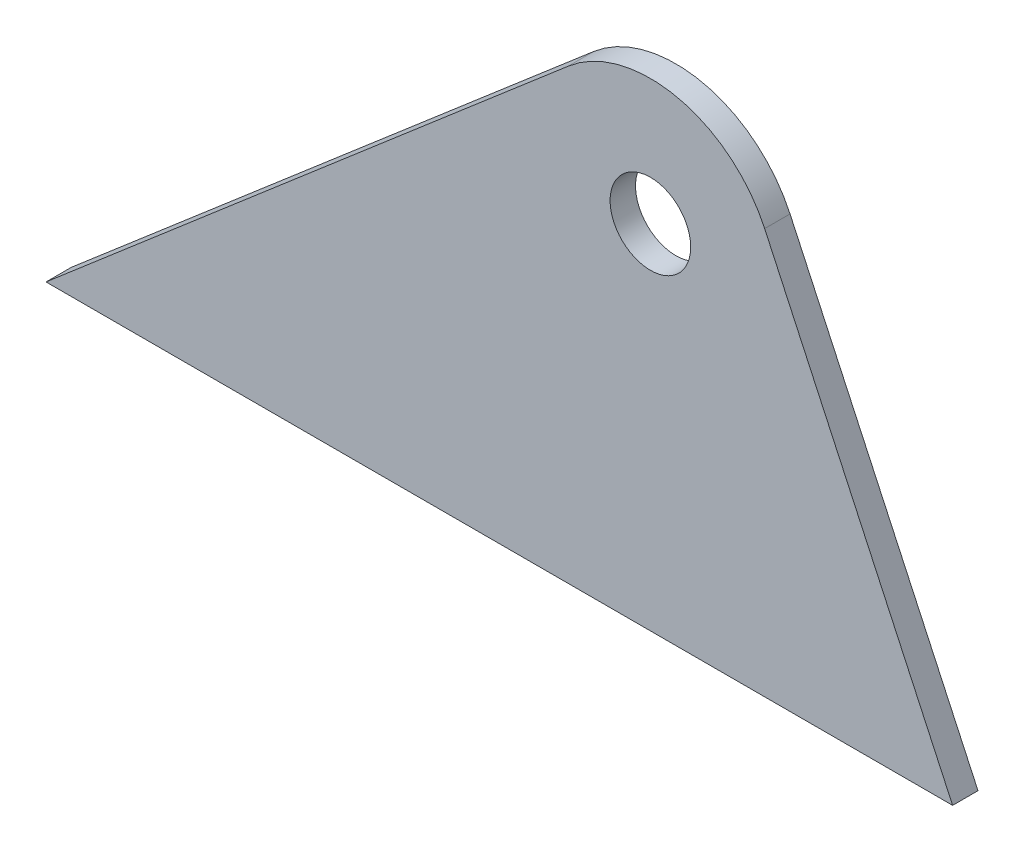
ISO-10303-21;
HEADER;
FILE_DESCRIPTION(('STEP AP214'),'2;1');
FILE_NAME('part.step','',(''),(''),'','','');
FILE_SCHEMA(('AUTOMOTIVE_DESIGN { 1 0 10303 214 1 1 1 1 }'));
ENDSEC;
DATA;
#1=APPLICATION_CONTEXT('core data for automotive mechanical design processes');
#2=APPLICATION_PROTOCOL_DEFINITION('international standard','automotive_design',2000,#1);
#3=PRODUCT_CONTEXT('',#1,'mechanical');
#4=PRODUCT('Part','Part','',(#3));
#5=PRODUCT_RELATED_PRODUCT_CATEGORY('part','',(#4));
#6=PRODUCT_DEFINITION_FORMATION('','',#4);
#7=PRODUCT_DEFINITION_CONTEXT('part definition',#1,'design');
#8=PRODUCT_DEFINITION('design','',#6,#7);
#9=PRODUCT_DEFINITION_SHAPE('','',#8);
#10=(LENGTH_UNIT() NAMED_UNIT(*) SI_UNIT(.MILLI.,.METRE.));
#11=(NAMED_UNIT(*) PLANE_ANGLE_UNIT() SI_UNIT($,.RADIAN.));
#12=(NAMED_UNIT(*) SI_UNIT($,.STERADIAN.) SOLID_ANGLE_UNIT());
#13=UNCERTAINTY_MEASURE_WITH_UNIT(LENGTH_MEASURE(1.E-05),#10,'distance_accuracy_value','');
#14=(GEOMETRIC_REPRESENTATION_CONTEXT(3) GLOBAL_UNCERTAINTY_ASSIGNED_CONTEXT((#13)) GLOBAL_UNIT_ASSIGNED_CONTEXT((#10,
#11,#12)) REPRESENTATION_CONTEXT('',''));
#15=CARTESIAN_POINT('',(0.,0.,0.));
#16=DIRECTION('',(0.,0.,1.));
#17=DIRECTION('',(1.,0.,0.));
#18=AXIS2_PLACEMENT_3D('',#15,#16,#17);
#19=CARTESIAN_POINT('',(0.,0.,1.6002));
#20=DIRECTION('',(0.,0.,1.));
#21=DIRECTION('',(1.,0.,0.));
#22=AXIS2_PLACEMENT_3D('',#19,#20,#21);
#23=PLANE('',#22);
#24=DIRECTION('',(1.,0.,0.));
#25=VECTOR('',#24,1.);
#26=CARTESIAN_POINT('',(-38.1,-22.225,1.6002));
#27=LINE('',#26,#25);
#28=CARTESIAN_POINT('',(-38.1,-22.225,1.6002));
#29=VERTEX_POINT('',#28);
#30=CARTESIAN_POINT('',(19.05,-22.225,1.6002));
#31=VERTEX_POINT('',#30);
#32=EDGE_CURVE('E86',#29,#31,#27,.T.);
#33=ORIENTED_EDGE('',*,*,#32,.T.);
#34=DIRECTION('',(-0.420526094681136,0.907280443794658,0.));
#35=VECTOR('',#34,1.);
#36=CARTESIAN_POINT('',(19.05,-22.225,1.6002));
#37=LINE('',#36,#35);
#38=CARTESIAN_POINT('',(7.2015385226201,3.33792587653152,1.6002));
#39=VERTEX_POINT('',#38);
#40=EDGE_CURVE('E81',#31,#39,#37,.T.);
#41=ORIENTED_EDGE('',*,*,#40,.T.);
#42=CARTESIAN_POINT('',(0.,0.,1.6002));
#43=DIRECTION('',(0.,0.,1.));
#44=DIRECTION('',(1.,0.,0.));
#45=AXIS2_PLACEMENT_3D('',#42,#43,#44);
#46=CIRCLE('',#45,7.9375);
#47=CARTESIAN_POINT('',(-5.167993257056,6.02459558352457,1.6002));
#48=VERTEX_POINT('',#47);
#49=EDGE_CURVE('E84',#39,#48,#46,.T.);
#50=ORIENTED_EDGE('',*,*,#49,.T.);
#51=DIRECTION('',(-0.759004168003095,-0.651085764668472,0.));
#52=VECTOR('',#51,1.);
#53=CARTESIAN_POINT('',(-5.167993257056,6.02459558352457,1.6002));
#54=LINE('',#53,#52);
#55=EDGE_CURVE('E51',#48,#29,#54,.T.);
#56=ORIENTED_EDGE('',*,*,#55,.T.);
#57=EDGE_LOOP('',(#33,#41,#50,#56));
#58=FACE_BOUND('',#57,.T.);
#59=CARTESIAN_POINT('',(0.,0.,1.6002));
#60=DIRECTION('',(0.,0.,1.));
#61=DIRECTION('',(1.,0.,0.));
#62=AXIS2_PLACEMENT_3D('',#59,#60,#61);
#63=CIRCLE('',#62,2.54);
#64=CARTESIAN_POINT('',(2.54,0.,1.6002));
#65=VERTEX_POINT('',#64);
#66=EDGE_CURVE('E101',#65,#65,#63,.T.);
#67=ORIENTED_EDGE('',*,*,#66,.F.);
#68=EDGE_LOOP('',(#67));
#69=FACE_BOUND('',#68,.T.);
#70=ADVANCED_FACE('F34',(#58,#69),#23,.T.);
#71=CARTESIAN_POINT('',(0.,0.,0.));
#72=DIRECTION('',(0.,0.,1.));
#73=DIRECTION('',(1.,0.,0.));
#74=AXIS2_PLACEMENT_3D('',#71,#72,#73);
#75=PLANE('',#74);
#76=DIRECTION('',(1.,0.,0.));
#77=VECTOR('',#76,1.);
#78=CARTESIAN_POINT('',(-38.1,-22.225,0.));
#79=LINE('',#78,#77);
#80=CARTESIAN_POINT('',(-38.1,-22.225,0.));
#81=VERTEX_POINT('',#80);
#82=CARTESIAN_POINT('',(19.05,-22.225,0.));
#83=VERTEX_POINT('',#82);
#84=EDGE_CURVE('E98',#81,#83,#79,.T.);
#85=ORIENTED_EDGE('',*,*,#84,.F.);
#86=DIRECTION('',(-0.759004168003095,-0.651085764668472,0.));
#87=VECTOR('',#86,1.);
#88=CARTESIAN_POINT('',(-5.167993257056,6.02459558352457,0.));
#89=LINE('',#88,#87);
#90=CARTESIAN_POINT('',(-5.167993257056,6.02459558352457,0.));
#91=VERTEX_POINT('',#90);
#92=EDGE_CURVE('E74',#91,#81,#89,.T.);
#93=ORIENTED_EDGE('',*,*,#92,.F.);
#94=CARTESIAN_POINT('',(0.,0.,0.));
#95=DIRECTION('',(0.,0.,1.));
#96=DIRECTION('',(1.,0.,0.));
#97=AXIS2_PLACEMENT_3D('',#94,#95,#96);
#98=CIRCLE('',#97,7.9375);
#99=CARTESIAN_POINT('',(7.2015385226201,3.33792587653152,0.));
#100=VERTEX_POINT('',#99);
#101=EDGE_CURVE('E68',#100,#91,#98,.T.);
#102=ORIENTED_EDGE('',*,*,#101,.F.);
#103=DIRECTION('',(-0.420526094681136,0.907280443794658,0.));
#104=VECTOR('',#103,1.);
#105=CARTESIAN_POINT('',(19.05,-22.225,0.));
#106=LINE('',#105,#104);
#107=EDGE_CURVE('E90',#83,#100,#106,.T.);
#108=ORIENTED_EDGE('',*,*,#107,.F.);
#109=EDGE_LOOP('',(#85,#93,#102,#108));
#110=FACE_BOUND('',#109,.T.);
#111=CARTESIAN_POINT('',(0.,0.,0.));
#112=DIRECTION('',(0.,0.,1.));
#113=DIRECTION('',(1.,0.,0.));
#114=AXIS2_PLACEMENT_3D('',#111,#112,#113);
#115=CIRCLE('',#114,2.54);
#116=CARTESIAN_POINT('',(2.54,0.,0.));
#117=VERTEX_POINT('',#116);
#118=EDGE_CURVE('E113',#117,#117,#115,.T.);
#119=ORIENTED_EDGE('',*,*,#118,.T.);
#120=EDGE_LOOP('',(#119));
#121=FACE_BOUND('',#120,.T.);
#122=ADVANCED_FACE('F109',(#110,#121),#75,.F.);
#123=CARTESIAN_POINT('',(-38.1,-22.225,1.6002));
#124=DIRECTION('',(0.,1.,0.));
#125=DIRECTION('',(0.,0.,1.));
#126=AXIS2_PLACEMENT_3D('',#123,#124,#125);
#127=PLANE('',#126);
#128=ORIENTED_EDGE('',*,*,#84,.T.);
#129=DIRECTION('',(0.,0.,-1.));
#130=VECTOR('',#129,1.);
#131=CARTESIAN_POINT('',(19.05,-22.225,1.6002));
#132=LINE('',#131,#130);
#133=EDGE_CURVE('E11',#31,#83,#132,.T.);
#134=ORIENTED_EDGE('',*,*,#133,.F.);
#135=ORIENTED_EDGE('',*,*,#32,.F.);
#136=DIRECTION('',(0.,0.,-1.));
#137=VECTOR('',#136,1.);
#138=CARTESIAN_POINT('',(-38.1,-22.225,1.6002));
#139=LINE('',#138,#137);
#140=EDGE_CURVE('E94',#29,#81,#139,.T.);
#141=ORIENTED_EDGE('',*,*,#140,.T.);
#142=EDGE_LOOP('',(#128,#134,#135,#141));
#143=FACE_BOUND('',#142,.T.);
#144=ADVANCED_FACE('F36',(#143),#127,.F.);
#145=CARTESIAN_POINT('',(19.05,-22.225,1.6002));
#146=DIRECTION('',(-0.907280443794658,-0.420526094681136,0.));
#147=DIRECTION('',(0.420526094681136,-0.907280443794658,0.));
#148=AXIS2_PLACEMENT_3D('',#145,#146,#147);
#149=PLANE('',#148);
#150=ORIENTED_EDGE('',*,*,#107,.T.);
#151=DIRECTION('',(0.,0.,-1.));
#152=VECTOR('',#151,1.);
#153=CARTESIAN_POINT('',(7.2015385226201,3.33792587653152,1.6002));
#154=LINE('',#153,#152);
#155=EDGE_CURVE('E43',#39,#100,#154,.T.);
#156=ORIENTED_EDGE('',*,*,#155,.F.);
#157=ORIENTED_EDGE('',*,*,#40,.F.);
#158=ORIENTED_EDGE('',*,*,#133,.T.);
#159=EDGE_LOOP('',(#150,#156,#157,#158));
#160=FACE_BOUND('',#159,.T.);
#161=ADVANCED_FACE('F89',(#160),#149,.F.);
#162=CARTESIAN_POINT('',(0.,0.,1.6002));
#163=DIRECTION('',(0.,0.,-1.));
#164=DIRECTION('',(-1.,0.,0.));
#165=AXIS2_PLACEMENT_3D('',#162,#163,#164);
#166=CYLINDRICAL_SURFACE('',#165,7.9375);
#167=ORIENTED_EDGE('',*,*,#101,.T.);
#168=DIRECTION('',(0.,0.,-1.));
#169=VECTOR('',#168,1.);
#170=CARTESIAN_POINT('',(-5.167993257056,6.02459558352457,1.6002));
#171=LINE('',#170,#169);
#172=EDGE_CURVE('E91',#48,#91,#171,.T.);
#173=ORIENTED_EDGE('',*,*,#172,.F.);
#174=ORIENTED_EDGE('',*,*,#49,.F.);
#175=ORIENTED_EDGE('',*,*,#155,.T.);
#176=EDGE_LOOP('',(#167,#173,#174,#175));
#177=FACE_BOUND('',#176,.T.);
#178=ADVANCED_FACE('F92',(#177),#166,.T.);
#179=CARTESIAN_POINT('',(-5.167993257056,6.02459558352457,1.6002));
#180=DIRECTION('',(0.651085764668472,-0.759004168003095,0.));
#181=DIRECTION('',(0.759004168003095,0.651085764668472,0.));
#182=AXIS2_PLACEMENT_3D('',#179,#180,#181);
#183=PLANE('',#182);
#184=ORIENTED_EDGE('',*,*,#92,.T.);
#185=ORIENTED_EDGE('',*,*,#140,.F.);
#186=ORIENTED_EDGE('',*,*,#55,.F.);
#187=ORIENTED_EDGE('',*,*,#172,.T.);
#188=EDGE_LOOP('',(#184,#185,#186,#187));
#189=FACE_BOUND('',#188,.T.);
#190=ADVANCED_FACE('F106',(#189),#183,.F.);
#191=CARTESIAN_POINT('',(0.,0.,1.6002));
#192=DIRECTION('',(0.,0.,-1.));
#193=DIRECTION('',(-1.,0.,0.));
#194=AXIS2_PLACEMENT_3D('',#191,#192,#193);
#195=CYLINDRICAL_SURFACE('',#194,2.54);
#196=ORIENTED_EDGE('',*,*,#66,.T.);
#197=EDGE_LOOP('',(#196));
#198=FACE_BOUND('',#197,.T.);
#199=ORIENTED_EDGE('',*,*,#118,.F.);
#200=EDGE_LOOP('',(#199));
#201=FACE_BOUND('',#200,.T.);
#202=ADVANCED_FACE('F119',(#198,#201),#195,.F.);
#203=CLOSED_SHELL('',(#70,#122,#144,#161,#178,#190,#202));
#204=MANIFOLD_SOLID_BREP('B2',#203);
#205=ADVANCED_BREP_SHAPE_REPRESENTATION('',(#18,#204),#14);
#206=SHAPE_DEFINITION_REPRESENTATION(#9,#205);
ENDSEC;
END-ISO-10303-21;
